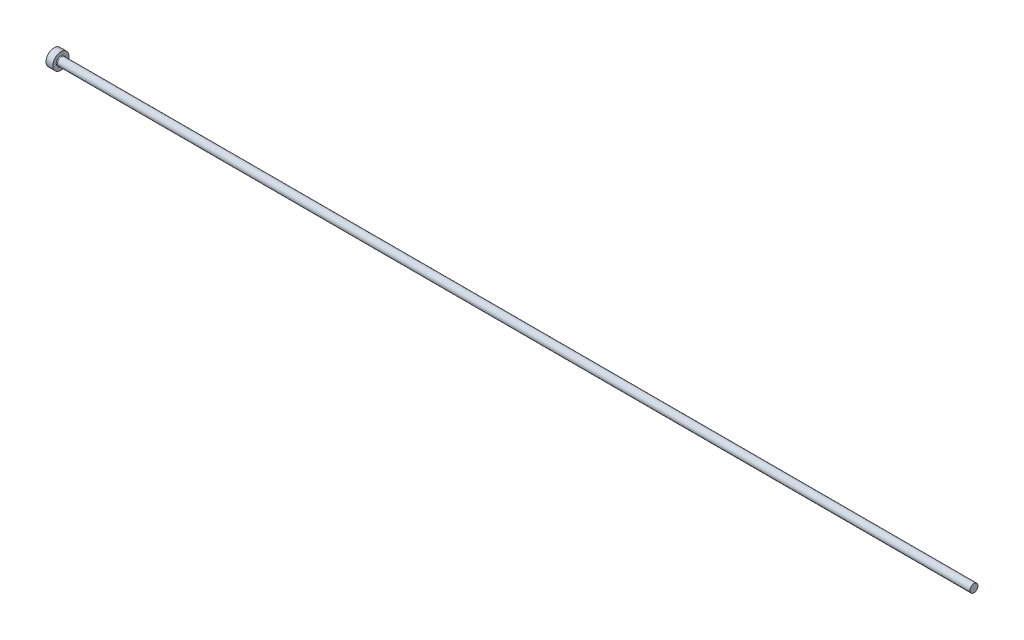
ISO-10303-21;
HEADER;
FILE_DESCRIPTION(('STEP AP214'),'2;1');
FILE_NAME('part.step','',(''),(''),'','','');
FILE_SCHEMA(('AUTOMOTIVE_DESIGN { 1 0 10303 214 1 1 1 1 }'));
ENDSEC;
DATA;
#1=APPLICATION_CONTEXT('core data for automotive mechanical design processes');
#2=APPLICATION_PROTOCOL_DEFINITION('international standard','automotive_design',2000,#1);
#3=PRODUCT_CONTEXT('',#1,'mechanical');
#4=PRODUCT('Part','Part','',(#3));
#5=PRODUCT_RELATED_PRODUCT_CATEGORY('part','',(#4));
#6=PRODUCT_DEFINITION_FORMATION('','',#4);
#7=PRODUCT_DEFINITION_CONTEXT('part definition',#1,'design');
#8=PRODUCT_DEFINITION('design','',#6,#7);
#9=PRODUCT_DEFINITION_SHAPE('','',#8);
#10=(LENGTH_UNIT() NAMED_UNIT(*) SI_UNIT(.MILLI.,.METRE.));
#11=(NAMED_UNIT(*) PLANE_ANGLE_UNIT() SI_UNIT($,.RADIAN.));
#12=(NAMED_UNIT(*) SI_UNIT($,.STERADIAN.) SOLID_ANGLE_UNIT());
#13=UNCERTAINTY_MEASURE_WITH_UNIT(LENGTH_MEASURE(1.E-05),#10,'distance_accuracy_value','');
#14=(GEOMETRIC_REPRESENTATION_CONTEXT(3) GLOBAL_UNCERTAINTY_ASSIGNED_CONTEXT((#13)) GLOBAL_UNIT_ASSIGNED_CONTEXT((#10,
#11,#12)) REPRESENTATION_CONTEXT('',''));
#15=CARTESIAN_POINT('',(0.,0.,0.));
#16=DIRECTION('',(0.,0.,1.));
#17=DIRECTION('',(1.,0.,0.));
#18=AXIS2_PLACEMENT_3D('',#15,#16,#17);
#19=CARTESIAN_POINT('',(0.,0.,0.));
#20=DIRECTION('',(-1.,0.,0.));
#21=DIRECTION('',(0.,-1.,0.));
#22=AXIS2_PLACEMENT_3D('',#19,#20,#21);
#23=PLANE('',#22);
#24=CARTESIAN_POINT('',(0.,0.,0.));
#25=DIRECTION('',(1.,0.,0.));
#26=DIRECTION('',(0.,1.,0.));
#27=AXIS2_PLACEMENT_3D('',#24,#25,#26);
#28=CIRCLE('',#27,3.5);
#29=CARTESIAN_POINT('',(0.,3.5,0.));
#30=VERTEX_POINT('',#29);
#31=EDGE_CURVE('E25',#30,#30,#28,.T.);
#32=ORIENTED_EDGE('',*,*,#31,.F.);
#33=EDGE_LOOP('',(#32));
#34=FACE_BOUND('',#33,.T.);
#35=ADVANCED_FACE('F14',(#34),#23,.T.);
#36=CARTESIAN_POINT('',(400.,0.,0.));
#37=DIRECTION('',(1.,0.,0.));
#38=DIRECTION('',(0.,1.,0.));
#39=AXIS2_PLACEMENT_3D('',#36,#37,#38);
#40=CYLINDRICAL_SURFACE('',#39,3.5);
#41=ORIENTED_EDGE('',*,*,#31,.T.);
#42=EDGE_LOOP('',(#41));
#43=FACE_BOUND('',#42,.T.);
#44=CARTESIAN_POINT('',(3.,0.,0.));
#45=DIRECTION('',(1.,0.,0.));
#46=DIRECTION('',(0.,1.,0.));
#47=AXIS2_PLACEMENT_3D('',#44,#45,#46);
#48=CIRCLE('',#47,3.5);
#49=CARTESIAN_POINT('',(3.,3.5,0.));
#50=VERTEX_POINT('',#49);
#51=EDGE_CURVE('E29',#50,#50,#48,.T.);
#52=ORIENTED_EDGE('',*,*,#51,.F.);
#53=EDGE_LOOP('',(#52));
#54=FACE_BOUND('',#53,.T.);
#55=ADVANCED_FACE('F51',(#43,#54),#40,.T.);
#56=CARTESIAN_POINT('',(3.,3.5,0.));
#57=DIRECTION('',(1.,0.,0.));
#58=DIRECTION('',(0.,1.,0.));
#59=AXIS2_PLACEMENT_3D('',#56,#57,#58);
#60=PLANE('',#59);
#61=CARTESIAN_POINT('',(3.,0.,0.));
#62=DIRECTION('',(1.,0.,0.));
#63=DIRECTION('',(0.,1.,0.));
#64=AXIS2_PLACEMENT_3D('',#61,#62,#63);
#65=CIRCLE('',#64,2.04999999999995);
#66=CARTESIAN_POINT('',(3.,2.04999999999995,0.));
#67=VERTEX_POINT('',#66);
#68=EDGE_CURVE('E9',#67,#67,#65,.F.);
#69=ORIENTED_EDGE('',*,*,#68,.T.);
#70=EDGE_LOOP('',(#69));
#71=FACE_BOUND('',#70,.T.);
#72=ORIENTED_EDGE('',*,*,#51,.T.);
#73=EDGE_LOOP('',(#72));
#74=FACE_BOUND('',#73,.T.);
#75=ADVANCED_FACE('F42',(#71,#74),#60,.T.);
#76=CARTESIAN_POINT('',(400.,0.,0.));
#77=DIRECTION('',(1.,0.,0.));
#78=DIRECTION('',(0.,1.,0.));
#79=AXIS2_PLACEMENT_3D('',#76,#77,#78);
#80=CYLINDRICAL_SURFACE('',#79,1.74999999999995);
#81=CARTESIAN_POINT('',(3.3,0.,0.));
#82=DIRECTION('',(1.,0.,0.));
#83=DIRECTION('',(0.,1.,0.));
#84=AXIS2_PLACEMENT_3D('',#81,#82,#83);
#85=CIRCLE('',#84,1.74999999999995);
#86=CARTESIAN_POINT('',(3.3,1.74999999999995,0.));
#87=VERTEX_POINT('',#86);
#88=EDGE_CURVE('E21',#87,#87,#85,.T.);
#89=ORIENTED_EDGE('',*,*,#88,.T.);
#90=EDGE_LOOP('',(#89));
#91=FACE_BOUND('',#90,.T.);
#92=CARTESIAN_POINT('',(400.,0.,0.));
#93=DIRECTION('',(1.,0.,0.));
#94=DIRECTION('',(0.,1.,0.));
#95=AXIS2_PLACEMENT_3D('',#92,#93,#94);
#96=CIRCLE('',#95,1.74999999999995);
#97=CARTESIAN_POINT('',(400.,1.74999999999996,0.));
#98=VERTEX_POINT('',#97);
#99=EDGE_CURVE('E34',#98,#98,#96,.T.);
#100=ORIENTED_EDGE('',*,*,#99,.F.);
#101=EDGE_LOOP('',(#100));
#102=FACE_BOUND('',#101,.T.);
#103=ADVANCED_FACE('F40',(#91,#102),#80,.T.);
#104=CARTESIAN_POINT('',(400.,1.74999999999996,0.));
#105=DIRECTION('',(1.,0.,0.));
#106=DIRECTION('',(0.,1.,0.));
#107=AXIS2_PLACEMENT_3D('',#104,#105,#106);
#108=PLANE('',#107);
#109=ORIENTED_EDGE('',*,*,#99,.T.);
#110=EDGE_LOOP('',(#109));
#111=FACE_BOUND('',#110,.T.);
#112=ADVANCED_FACE('F38',(#111),#108,.T.);
#113=CARTESIAN_POINT('',(3.3,0.,0.));
#114=DIRECTION('',(1.,0.,0.));
#115=DIRECTION('',(0.,1.,0.));
#116=AXIS2_PLACEMENT_3D('',#113,#114,#115);
#117=TOROIDAL_SURFACE('',#116,2.04999999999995,0.3);
#118=ORIENTED_EDGE('',*,*,#68,.F.);
#119=EDGE_LOOP('',(#118));
#120=FACE_BOUND('',#119,.T.);
#121=ORIENTED_EDGE('',*,*,#88,.F.);
#122=EDGE_LOOP('',(#121));
#123=FACE_BOUND('',#122,.T.);
#124=ADVANCED_FACE('F16',(#120,#123),#117,.F.);
#125=CLOSED_SHELL('',(#35,#55,#75,#103,#112,#124));
#126=MANIFOLD_SOLID_BREP('B1',#125);
#127=ADVANCED_BREP_SHAPE_REPRESENTATION('',(#18,#126),#14);
#128=SHAPE_DEFINITION_REPRESENTATION(#9,#127);
ENDSEC;
END-ISO-10303-21;
